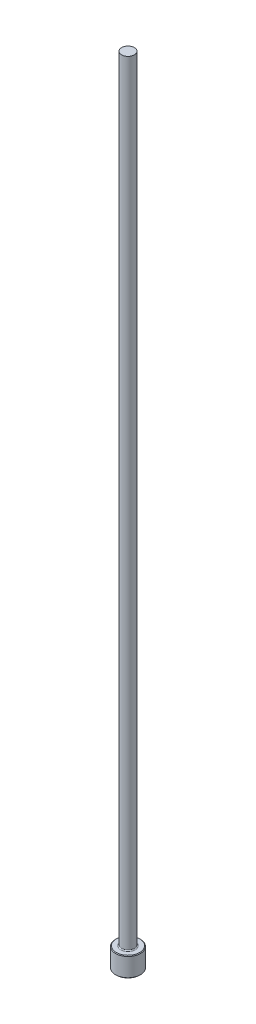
from build123d import *

# Parameters (mm, degrees)
CHAMFER1_SIZE = 0.0508
FILLET1_R     = 0.0762


with BuildPart() as part:
    # Sketch1 → Revolve1 (revolve)
    with BuildSketch(Plane.XY, mode=Mode.PRIVATE) as revolve1_sk:
        Polygon((0, 0), (-0.9906, 0), (-0.9906, 1.5748), (-0.508, 1.5748), (-0.508, 63.5), (0, 63.5), align=None)
    revolve(revolve1_sk.sketch.rotate(Axis((0, 259.958771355, 0), (0, -1, 0)), 270), axis=Axis((0, 259.958771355, 0), (0, -1, 0)))

    # Chamfer1
    chamfer1_edges = [part.edges().sort_by_distance(p)[0] for p in [
        (0, 1.5748, -0.9906),
        (0, 0, -0.9906),
    ]]
    chamfer(chamfer1_edges, length=CHAMFER1_SIZE)

    # Fillet1
    fillet1_edges = [part.edges().sort_by_distance(p)[0] for p in [
        (0, 1.5748, -0.508),
    ]]
    fillet(fillet1_edges, radius=FILLET1_R)


solid = part.part
